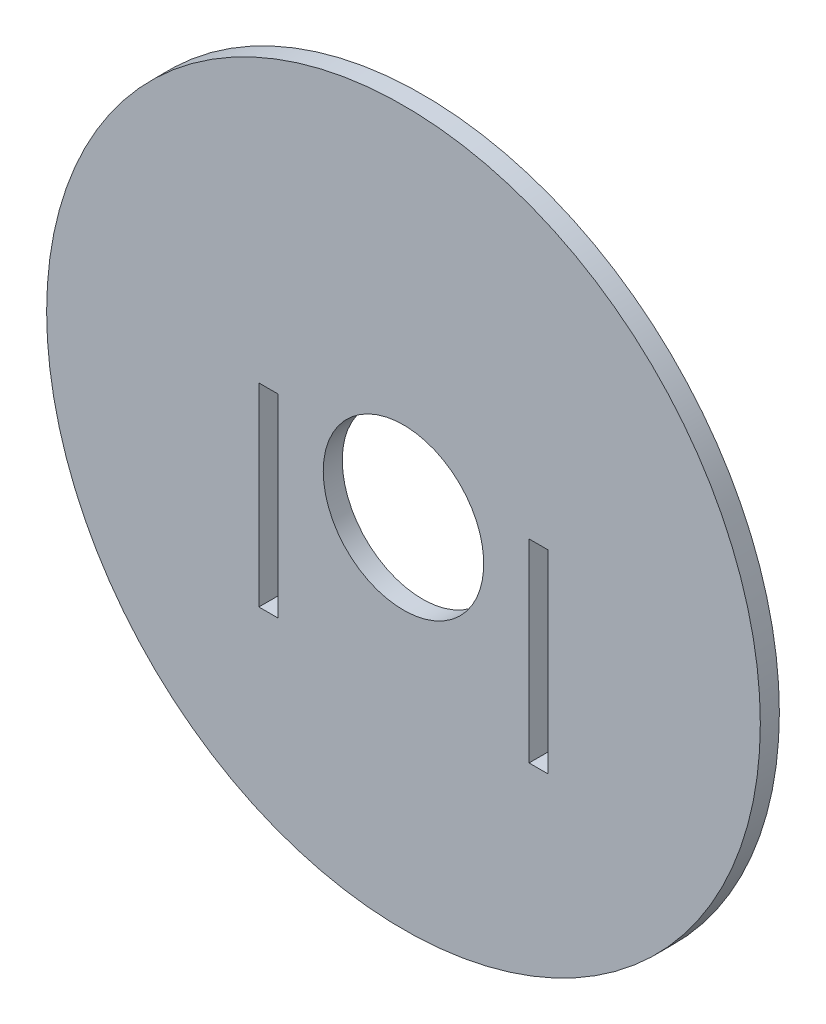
from build123d import *

# Parameters (mm, degrees)
SKETCH1_R           = 28.575
SKETCH1_R_2         = 6.4262
BOSS_EXTRUDE1_DEPTH = 1.524
SKETCH2_W           = 1.524
SKETCH2_H           = 15.536433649
CUT_EXTRUDE1_DEPTH  = 2.54


with BuildPart() as part:
    # Sketch1 → Boss-Extrude1 (new body)
    with BuildSketch(Plane.XY):
        with Locations(Location((59.45306863, -177.922739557, 0), (0, 0, 180))):
            Circle(SKETCH1_R)
        with Locations(Location((59.45306863, -177.922739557, 0), (0, 0, 180))):
            Circle(SKETCH1_R_2, mode=Mode.SUBTRACT)
    extrude(amount=BOSS_EXTRUDE1_DEPTH)

    # Sketch2 → Cut-Extrude1 (cut)
    with BuildSketch(Plane.XY.offset(1.524)):
        with Locations((48.636442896, -182.148527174)):
            Rectangle(SKETCH2_W, SKETCH2_H)
        with Locations((70.269694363, -182.148527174)):
            Rectangle(SKETCH2_W, SKETCH2_H)
    extrude(amount=-CUT_EXTRUDE1_DEPTH, mode=Mode.SUBTRACT)


solid = part.part
